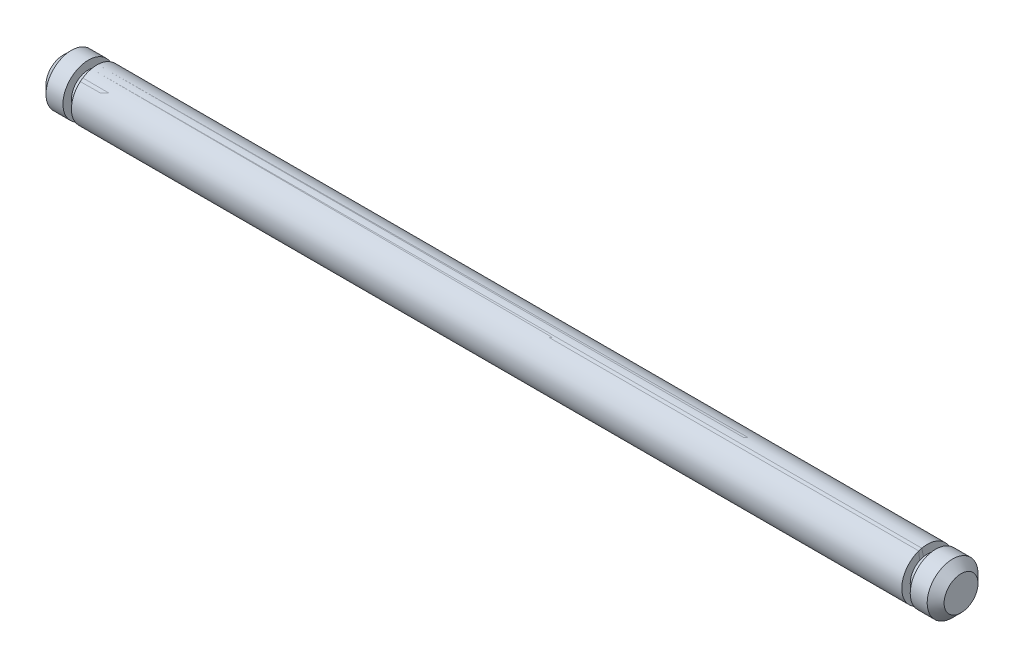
ISO-10303-21;
HEADER;
FILE_DESCRIPTION(('STEP AP214'),'2;1');
FILE_NAME('part.step','',(''),(''),'','','');
FILE_SCHEMA(('AUTOMOTIVE_DESIGN { 1 0 10303 214 1 1 1 1 }'));
ENDSEC;
DATA;
#1=APPLICATION_CONTEXT('core data for automotive mechanical design processes');
#2=APPLICATION_PROTOCOL_DEFINITION('international standard','automotive_design',2000,#1);
#3=PRODUCT_CONTEXT('',#1,'mechanical');
#4=PRODUCT('Part','Part','',(#3));
#5=PRODUCT_RELATED_PRODUCT_CATEGORY('part','',(#4));
#6=PRODUCT_DEFINITION_FORMATION('','',#4);
#7=PRODUCT_DEFINITION_CONTEXT('part definition',#1,'design');
#8=PRODUCT_DEFINITION('design','',#6,#7);
#9=PRODUCT_DEFINITION_SHAPE('','',#8);
#10=(LENGTH_UNIT() NAMED_UNIT(*) SI_UNIT(.MILLI.,.METRE.));
#11=(NAMED_UNIT(*) PLANE_ANGLE_UNIT() SI_UNIT($,.RADIAN.));
#12=(NAMED_UNIT(*) SI_UNIT($,.STERADIAN.) SOLID_ANGLE_UNIT());
#13=UNCERTAINTY_MEASURE_WITH_UNIT(LENGTH_MEASURE(1.E-05),#10,'distance_accuracy_value','');
#14=(GEOMETRIC_REPRESENTATION_CONTEXT(3) GLOBAL_UNCERTAINTY_ASSIGNED_CONTEXT((#13)) GLOBAL_UNIT_ASSIGNED_CONTEXT((#10,
#11,#12)) REPRESENTATION_CONTEXT('',''));
#15=CARTESIAN_POINT('',(0.,0.,0.));
#16=DIRECTION('',(0.,0.,1.));
#17=DIRECTION('',(1.,0.,0.));
#18=AXIS2_PLACEMENT_3D('',#15,#16,#17);
#19=CARTESIAN_POINT('',(-66.5,-1.3968022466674,0.22123174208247));
#20=DIRECTION('',(-1.,0.,0.));
#21=DIRECTION('',(0.,0.809016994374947,0.587785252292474));
#22=AXIS2_PLACEMENT_3D('',#19,#20,#21);
#23=PLANE('',#22);
#24=CARTESIAN_POINT('',(-66.5,0.,0.));
#25=DIRECTION('',(1.,0.,0.));
#26=DIRECTION('',(0.,0.,-1.));
#27=AXIS2_PLACEMENT_3D('',#24,#25,#26);
#28=CIRCLE('',#27,1.);
#29=CARTESIAN_POINT('',(-66.5,0.,-1.));
#30=VERTEX_POINT('',#29);
#31=EDGE_CURVE('P0_E406',#30,#30,#28,.F.);
#32=ORIENTED_EDGE('',*,*,#31,.T.);
#33=EDGE_LOOP('',(#32));
#34=FACE_BOUND('',#33,.T.);
#35=ADVANCED_FACE('P0_F348',(#34),#23,.T.);
#36=CARTESIAN_POINT('',(-66.,0.,0.));
#37=DIRECTION('',(1.,0.,0.));
#38=DIRECTION('',(0.,0.,-1.));
#39=AXIS2_PLACEMENT_3D('',#36,#37,#38);
#40=CONICAL_SURFACE('',#39,1.49999999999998,0.785398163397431);
#41=ORIENTED_EDGE('',*,*,#31,.F.);
#42=EDGE_LOOP('',(#41));
#43=FACE_BOUND('',#42,.T.);
#44=CARTESIAN_POINT('',(-66.,0.,0.));
#45=DIRECTION('',(-1.,0.,0.));
#46=DIRECTION('',(0.,0.809016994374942,0.58778525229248));
#47=AXIS2_PLACEMENT_3D('',#44,#45,#46);
#48=CIRCLE('',#47,1.49999999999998);
#49=CARTESIAN_POINT('',(-66.,1.2135254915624,0.88167787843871));
#50=VERTEX_POINT('',#49);
#51=EDGE_CURVE('P0_E404',#50,#50,#48,.T.);
#52=ORIENTED_EDGE('',*,*,#51,.T.);
#53=EDGE_LOOP('',(#52));
#54=FACE_BOUND('',#53,.T.);
#55=ADVANCED_FACE('P0_F442',(#43,#54),#40,.T.);
#56=CARTESIAN_POINT('',(-65.,0.,0.));
#57=DIRECTION('',(-1.,0.,0.));
#58=DIRECTION('',(0.,0.,1.));
#59=AXIS2_PLACEMENT_3D('',#56,#57,#58);
#60=CYLINDRICAL_SURFACE('',#59,1.49999999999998);
#61=ORIENTED_EDGE('',*,*,#51,.F.);
#62=EDGE_LOOP('',(#61));
#63=FACE_BOUND('',#62,.T.);
#64=CARTESIAN_POINT('',(-65.,0.,0.));
#65=DIRECTION('',(-1.,0.,0.));
#66=DIRECTION('',(0.,0.,1.));
#67=AXIS2_PLACEMENT_3D('',#64,#65,#66);
#68=CIRCLE('',#67,1.49999999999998);
#69=CARTESIAN_POINT('',(-65.,0.,1.49999999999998));
#70=VERTEX_POINT('',#69);
#71=EDGE_CURVE('P0_E399',#70,#70,#68,.F.);
#72=ORIENTED_EDGE('',*,*,#71,.F.);
#73=EDGE_LOOP('',(#72));
#74=FACE_BOUND('',#73,.T.);
#75=ADVANCED_FACE('P0_F447',(#63,#74),#60,.T.);
#76=CARTESIAN_POINT('',(-65.,-0.33184761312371,-2.0952033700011));
#77=DIRECTION('',(1.,0.,0.));
#78=DIRECTION('',(0.,0.809016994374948,0.587785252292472));
#79=AXIS2_PLACEMENT_3D('',#76,#77,#78);
#80=PLANE('',#79);
#81=CARTESIAN_POINT('',(-65.,0.,0.));
#82=DIRECTION('',(-1.,0.,0.));
#83=DIRECTION('',(0.,0.,1.));
#84=AXIS2_PLACEMENT_3D('',#81,#82,#83);
#85=CIRCLE('',#84,1.);
#86=CARTESIAN_POINT('',(-65.,0.,1.));
#87=VERTEX_POINT('',#86);
#88=EDGE_CURVE('P0_E394',#87,#87,#85,.T.);
#89=ORIENTED_EDGE('',*,*,#88,.T.);
#90=EDGE_LOOP('',(#89));
#91=FACE_BOUND('',#90,.T.);
#92=ORIENTED_EDGE('',*,*,#71,.T.);
#93=EDGE_LOOP('',(#92));
#94=FACE_BOUND('',#93,.T.);
#95=ADVANCED_FACE('P0_F443',(#91,#94),#80,.T.);
#96=CARTESIAN_POINT('',(-64.5,0.,0.));
#97=DIRECTION('',(-1.,0.,0.));
#98=DIRECTION('',(0.,0.,1.));
#99=AXIS2_PLACEMENT_3D('',#96,#97,#98);
#100=CYLINDRICAL_SURFACE('',#99,1.);
#101=ORIENTED_EDGE('',*,*,#88,.F.);
#102=EDGE_LOOP('',(#101));
#103=FACE_BOUND('',#102,.T.);
#104=CARTESIAN_POINT('',(-64.5,0.,0.));
#105=DIRECTION('',(-1.,0.,0.));
#106=DIRECTION('',(0.,0.,1.));
#107=AXIS2_PLACEMENT_3D('',#104,#105,#106);
#108=CIRCLE('',#107,1.);
#109=CARTESIAN_POINT('',(-64.5,0.,1.));
#110=VERTEX_POINT('',#109);
#111=EDGE_CURVE('P0_E389',#110,#110,#108,.F.);
#112=ORIENTED_EDGE('',*,*,#111,.F.);
#113=EDGE_LOOP('',(#112));
#114=FACE_BOUND('',#113,.T.);
#115=ADVANCED_FACE('P0_F446',(#103,#114),#100,.T.);
#116=CARTESIAN_POINT('',(-64.5,-2.0952033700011,0.33184761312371));
#117=DIRECTION('',(-1.,0.,0.));
#118=DIRECTION('',(0.,0.809016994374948,0.587785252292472));
#119=AXIS2_PLACEMENT_3D('',#116,#117,#118);
#120=PLANE('',#119);
#121=ORIENTED_EDGE('',*,*,#111,.T.);
#122=EDGE_LOOP('',(#121));
#123=FACE_BOUND('',#122,.T.);
#124=CARTESIAN_POINT('',(-64.5,0.,0.));
#125=DIRECTION('',(-1.,0.,0.));
#126=DIRECTION('',(0.,0.,1.));
#127=AXIS2_PLACEMENT_3D('',#124,#125,#126);
#128=CIRCLE('',#127,1.49999999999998);
#129=CARTESIAN_POINT('',(-64.5,0.,1.49999999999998));
#130=VERTEX_POINT('',#129);
#131=EDGE_CURVE('P0_E384',#130,#130,#128,.T.);
#132=ORIENTED_EDGE('',*,*,#131,.T.);
#133=EDGE_LOOP('',(#132));
#134=FACE_BOUND('',#133,.T.);
#135=ADVANCED_FACE('P0_F449',(#123,#134),#120,.T.);
#136=CARTESIAN_POINT('',(-13.5,-0.22123174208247,-1.3968022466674));
#137=DIRECTION('',(1.,0.,0.));
#138=DIRECTION('',(0.,0.809016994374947,0.587785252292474));
#139=AXIS2_PLACEMENT_3D('',#136,#137,#138);
#140=PLANE('',#139);
#141=CARTESIAN_POINT('',(-13.5,0.,0.));
#142=DIRECTION('',(-1.,0.,0.));
#143=DIRECTION('',(0.,0.,1.));
#144=AXIS2_PLACEMENT_3D('',#141,#142,#143);
#145=CIRCLE('',#144,1.);
#146=CARTESIAN_POINT('',(-13.5,0.,1.));
#147=VERTEX_POINT('',#146);
#148=EDGE_CURVE('P0_E379',#147,#147,#145,.F.);
#149=ORIENTED_EDGE('',*,*,#148,.T.);
#150=EDGE_LOOP('',(#149));
#151=FACE_BOUND('',#150,.T.);
#152=ADVANCED_FACE('P0_F452',(#151),#140,.T.);
#153=CARTESIAN_POINT('',(-15.5,0.,0.));
#154=DIRECTION('',(-1.,0.,0.));
#155=DIRECTION('',(0.,0.,1.));
#156=AXIS2_PLACEMENT_3D('',#153,#154,#155);
#157=CYLINDRICAL_SURFACE('',#156,1.49999999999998);
#158=ORIENTED_EDGE('',*,*,#131,.F.);
#159=EDGE_LOOP('',(#158));
#160=FACE_BOUND('',#159,.T.);
#161=CARTESIAN_POINT('',(-15.5,0.,0.));
#162=DIRECTION('',(-1.,0.,0.));
#163=DIRECTION('',(0.,0.,1.));
#164=AXIS2_PLACEMENT_3D('',#161,#162,#163);
#165=CIRCLE('',#164,1.49999999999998);
#166=CARTESIAN_POINT('',(-15.5,0.,1.49999999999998));
#167=VERTEX_POINT('',#166);
#168=EDGE_CURVE('P0_E376',#167,#167,#165,.F.);
#169=ORIENTED_EDGE('',*,*,#168,.F.);
#170=EDGE_LOOP('',(#169));
#171=FACE_BOUND('',#170,.T.);
#172=ADVANCED_FACE('P0_F455',(#160,#171),#157,.T.);
#173=CARTESIAN_POINT('',(-13.5,0.,0.));
#174=DIRECTION('',(-1.,0.,0.));
#175=DIRECTION('',(0.,0.,1.));
#176=AXIS2_PLACEMENT_3D('',#173,#174,#175);
#177=CONICAL_SURFACE('',#176,1.,0.785398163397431);
#178=ORIENTED_EDGE('',*,*,#148,.F.);
#179=EDGE_LOOP('',(#178));
#180=FACE_BOUND('',#179,.T.);
#181=CARTESIAN_POINT('',(-14.,0.,0.));
#182=DIRECTION('',(-1.,0.,0.));
#183=DIRECTION('',(0.,0.809016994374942,0.58778525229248));
#184=AXIS2_PLACEMENT_3D('',#181,#182,#183);
#185=CIRCLE('',#184,1.49999999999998);
#186=CARTESIAN_POINT('',(-14.,1.2135254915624,0.88167787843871));
#187=VERTEX_POINT('',#186);
#188=EDGE_CURVE('P0_E373',#187,#187,#185,.F.);
#189=ORIENTED_EDGE('',*,*,#188,.T.);
#190=EDGE_LOOP('',(#189));
#191=FACE_BOUND('',#190,.T.);
#192=ADVANCED_FACE('P0_F419',(#180,#191),#177,.T.);
#193=CARTESIAN_POINT('',(-15.5,-0.33184761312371,-2.0952033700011));
#194=DIRECTION('',(1.,0.,0.));
#195=DIRECTION('',(0.,0.809016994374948,0.587785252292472));
#196=AXIS2_PLACEMENT_3D('',#193,#194,#195);
#197=PLANE('',#196);
#198=CARTESIAN_POINT('',(-15.5,0.,0.));
#199=DIRECTION('',(-1.,0.,0.));
#200=DIRECTION('',(0.,0.,1.));
#201=AXIS2_PLACEMENT_3D('',#198,#199,#200);
#202=CIRCLE('',#201,1.);
#203=CARTESIAN_POINT('',(-15.5,0.,1.));
#204=VERTEX_POINT('',#203);
#205=EDGE_CURVE('P0_E361',#204,#204,#202,.T.);
#206=ORIENTED_EDGE('',*,*,#205,.T.);
#207=EDGE_LOOP('',(#206));
#208=FACE_BOUND('',#207,.T.);
#209=ORIENTED_EDGE('',*,*,#168,.T.);
#210=EDGE_LOOP('',(#209));
#211=FACE_BOUND('',#210,.T.);
#212=ADVANCED_FACE('P0_F425',(#208,#211),#197,.T.);
#213=CARTESIAN_POINT('',(-14.,0.,0.));
#214=DIRECTION('',(-1.,0.,0.));
#215=DIRECTION('',(0.,0.,1.));
#216=AXIS2_PLACEMENT_3D('',#213,#214,#215);
#217=CYLINDRICAL_SURFACE('',#216,1.49999999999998);
#218=ORIENTED_EDGE('',*,*,#188,.F.);
#219=EDGE_LOOP('',(#218));
#220=FACE_BOUND('',#219,.T.);
#221=CARTESIAN_POINT('',(-15.,0.,0.));
#222=DIRECTION('',(-1.,0.,0.));
#223=DIRECTION('',(0.,0.,1.));
#224=AXIS2_PLACEMENT_3D('',#221,#222,#223);
#225=CIRCLE('',#224,1.49999999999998);
#226=CARTESIAN_POINT('',(-15.,0.,1.49999999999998));
#227=VERTEX_POINT('',#226);
#228=EDGE_CURVE('P0_E356',#227,#227,#225,.T.);
#229=ORIENTED_EDGE('',*,*,#228,.F.);
#230=EDGE_LOOP('',(#229));
#231=FACE_BOUND('',#230,.T.);
#232=ADVANCED_FACE('P0_F421',(#220,#231),#217,.T.);
#233=CARTESIAN_POINT('',(-15.,0.,0.));
#234=DIRECTION('',(-1.,0.,0.));
#235=DIRECTION('',(0.,0.,1.));
#236=AXIS2_PLACEMENT_3D('',#233,#234,#235);
#237=CYLINDRICAL_SURFACE('',#236,1.);
#238=CARTESIAN_POINT('',(-15.,0.,0.));
#239=DIRECTION('',(-1.,0.,0.));
#240=DIRECTION('',(0.,0.,1.));
#241=AXIS2_PLACEMENT_3D('',#238,#239,#240);
#242=CIRCLE('',#241,1.);
#243=CARTESIAN_POINT('',(-15.,0.,1.));
#244=VERTEX_POINT('',#243);
#245=EDGE_CURVE('P0_E10',#244,#244,#242,.F.);
#246=ORIENTED_EDGE('',*,*,#245,.F.);
#247=EDGE_LOOP('',(#246));
#248=FACE_BOUND('',#247,.T.);
#249=ORIENTED_EDGE('',*,*,#205,.F.);
#250=EDGE_LOOP('',(#249));
#251=FACE_BOUND('',#250,.T.);
#252=ADVANCED_FACE('P0_F424',(#248,#251),#237,.T.);
#253=CARTESIAN_POINT('',(-15.,-2.0952033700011,0.33184761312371));
#254=DIRECTION('',(-1.,0.,0.));
#255=DIRECTION('',(0.,0.809016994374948,0.587785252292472));
#256=AXIS2_PLACEMENT_3D('',#253,#254,#255);
#257=PLANE('',#256);
#258=ORIENTED_EDGE('',*,*,#245,.T.);
#259=EDGE_LOOP('',(#258));
#260=FACE_BOUND('',#259,.T.);
#261=ORIENTED_EDGE('',*,*,#228,.T.);
#262=EDGE_LOOP('',(#261));
#263=FACE_BOUND('',#262,.T.);
#264=ADVANCED_FACE('P0_F350',(#260,#263),#257,.T.);
#265=CLOSED_SHELL('',(#35,#55,#75,#95,#115,#135,#152,#172,#192,#212,#232,#252,#264));
#266=MANIFOLD_SOLID_BREP('P0_B2',#265);
#267=CARTESIAN_POINT('',(-66.5,-1.3968022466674,0.22123174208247));
#268=DIRECTION('',(-1.,0.,0.));
#269=DIRECTION('',(0.,0.809016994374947,0.587785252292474));
#270=AXIS2_PLACEMENT_3D('',#267,#268,#269);
#271=PLANE('',#270);
#272=CARTESIAN_POINT('',(-66.5,0.,0.));
#273=DIRECTION('',(1.,0.,0.));
#274=DIRECTION('',(0.,0.,-1.));
#275=AXIS2_PLACEMENT_3D('',#272,#273,#274);
#276=CIRCLE('',#275,1.);
#277=CARTESIAN_POINT('',(-66.5,0.,-1.));
#278=VERTEX_POINT('',#277);
#279=EDGE_CURVE('P1_E72',#278,#278,#276,.F.);
#280=ORIENTED_EDGE('',*,*,#279,.T.);
#281=EDGE_LOOP('',(#280));
#282=FACE_BOUND('',#281,.T.);
#283=ADVANCED_FACE('P1_F14',(#282),#271,.T.);
#284=CARTESIAN_POINT('',(-66.,0.,0.));
#285=DIRECTION('',(1.,0.,0.));
#286=DIRECTION('',(0.,0.,-1.));
#287=AXIS2_PLACEMENT_3D('',#284,#285,#286);
#288=CONICAL_SURFACE('',#287,1.49999999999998,0.785398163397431);
#289=ORIENTED_EDGE('',*,*,#279,.F.);
#290=EDGE_LOOP('',(#289));
#291=FACE_BOUND('',#290,.T.);
#292=CARTESIAN_POINT('',(-66.,0.,0.));
#293=DIRECTION('',(-1.,0.,0.));
#294=DIRECTION('',(0.,0.809016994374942,0.58778525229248));
#295=AXIS2_PLACEMENT_3D('',#292,#293,#294);
#296=CIRCLE('',#295,1.49999999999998);
#297=CARTESIAN_POINT('',(-66.,1.2135254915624,0.88167787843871));
#298=VERTEX_POINT('',#297);
#299=EDGE_CURVE('P1_E70',#298,#298,#296,.T.);
#300=ORIENTED_EDGE('',*,*,#299,.T.);
#301=EDGE_LOOP('',(#300));
#302=FACE_BOUND('',#301,.T.);
#303=ADVANCED_FACE('P1_F100',(#291,#302),#288,.T.);
#304=CARTESIAN_POINT('',(-65.,0.,0.));
#305=DIRECTION('',(-1.,0.,0.));
#306=DIRECTION('',(0.,0.,1.));
#307=AXIS2_PLACEMENT_3D('',#304,#305,#306);
#308=CYLINDRICAL_SURFACE('',#307,1.49999999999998);
#309=ORIENTED_EDGE('',*,*,#299,.F.);
#310=EDGE_LOOP('',(#309));
#311=FACE_BOUND('',#310,.T.);
#312=CARTESIAN_POINT('',(-65.,0.,0.));
#313=DIRECTION('',(-1.,0.,0.));
#314=DIRECTION('',(0.,0.,1.));
#315=AXIS2_PLACEMENT_3D('',#312,#313,#314);
#316=CIRCLE('',#315,1.49999999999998);
#317=CARTESIAN_POINT('',(-65.,0.,1.49999999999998));
#318=VERTEX_POINT('',#317);
#319=EDGE_CURVE('P1_E65',#318,#318,#316,.F.);
#320=ORIENTED_EDGE('',*,*,#319,.F.);
#321=EDGE_LOOP('',(#320));
#322=FACE_BOUND('',#321,.T.);
#323=ADVANCED_FACE('P1_F104',(#311,#322),#308,.T.);
#324=CARTESIAN_POINT('',(-65.,-0.33184761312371,-2.0952033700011));
#325=DIRECTION('',(1.,0.,0.));
#326=DIRECTION('',(0.,0.809016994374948,0.587785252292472));
#327=AXIS2_PLACEMENT_3D('',#324,#325,#326);
#328=PLANE('',#327);
#329=CARTESIAN_POINT('',(-65.,0.,0.));
#330=DIRECTION('',(-1.,0.,0.));
#331=DIRECTION('',(0.,0.,1.));
#332=AXIS2_PLACEMENT_3D('',#329,#330,#331);
#333=CIRCLE('',#332,1.);
#334=CARTESIAN_POINT('',(-65.,0.,1.));
#335=VERTEX_POINT('',#334);
#336=EDGE_CURVE('P1_E60',#335,#335,#333,.T.);
#337=ORIENTED_EDGE('',*,*,#336,.T.);
#338=EDGE_LOOP('',(#337));
#339=FACE_BOUND('',#338,.T.);
#340=ORIENTED_EDGE('',*,*,#319,.T.);
#341=EDGE_LOOP('',(#340));
#342=FACE_BOUND('',#341,.T.);
#343=ADVANCED_FACE('P1_F101',(#339,#342),#328,.T.);
#344=CARTESIAN_POINT('',(-64.5,0.,0.));
#345=DIRECTION('',(-1.,0.,0.));
#346=DIRECTION('',(0.,0.,1.));
#347=AXIS2_PLACEMENT_3D('',#344,#345,#346);
#348=CYLINDRICAL_SURFACE('',#347,1.);
#349=ORIENTED_EDGE('',*,*,#336,.F.);
#350=EDGE_LOOP('',(#349));
#351=FACE_BOUND('',#350,.T.);
#352=CARTESIAN_POINT('',(-64.5,0.,0.));
#353=DIRECTION('',(-1.,0.,0.));
#354=DIRECTION('',(0.,0.,1.));
#355=AXIS2_PLACEMENT_3D('',#352,#353,#354);
#356=CIRCLE('',#355,1.);
#357=CARTESIAN_POINT('',(-64.5,0.,1.));
#358=VERTEX_POINT('',#357);
#359=EDGE_CURVE('P1_E55',#358,#358,#356,.F.);
#360=ORIENTED_EDGE('',*,*,#359,.F.);
#361=EDGE_LOOP('',(#360));
#362=FACE_BOUND('',#361,.T.);
#363=ADVANCED_FACE('P1_F103',(#351,#362),#348,.T.);
#364=CARTESIAN_POINT('',(-64.5,-2.0952033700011,0.33184761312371));
#365=DIRECTION('',(-1.,0.,0.));
#366=DIRECTION('',(0.,0.809016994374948,0.587785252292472));
#367=AXIS2_PLACEMENT_3D('',#364,#365,#366);
#368=PLANE('',#367);
#369=ORIENTED_EDGE('',*,*,#359,.T.);
#370=EDGE_LOOP('',(#369));
#371=FACE_BOUND('',#370,.T.);
#372=CARTESIAN_POINT('',(-64.5,0.,0.));
#373=DIRECTION('',(-1.,0.,0.));
#374=DIRECTION('',(0.,0.,1.));
#375=AXIS2_PLACEMENT_3D('',#372,#373,#374);
#376=CIRCLE('',#375,1.49999999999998);
#377=CARTESIAN_POINT('',(-64.5,0.,1.49999999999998));
#378=VERTEX_POINT('',#377);
#379=EDGE_CURVE('P1_E50',#378,#378,#376,.T.);
#380=ORIENTED_EDGE('',*,*,#379,.T.);
#381=EDGE_LOOP('',(#380));
#382=FACE_BOUND('',#381,.T.);
#383=ADVANCED_FACE('P1_F106',(#371,#382),#368,.T.);
#384=CARTESIAN_POINT('',(-13.5,-0.22123174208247,-1.3968022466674));
#385=DIRECTION('',(1.,0.,0.));
#386=DIRECTION('',(0.,0.809016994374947,0.587785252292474));
#387=AXIS2_PLACEMENT_3D('',#384,#385,#386);
#388=PLANE('',#387);
#389=CARTESIAN_POINT('',(-13.5,0.,0.));
#390=DIRECTION('',(-1.,0.,0.));
#391=DIRECTION('',(0.,0.,1.));
#392=AXIS2_PLACEMENT_3D('',#389,#390,#391);
#393=CIRCLE('',#392,1.);
#394=CARTESIAN_POINT('',(-13.5,0.,1.));
#395=VERTEX_POINT('',#394);
#396=EDGE_CURVE('P1_E45',#395,#395,#393,.F.);
#397=ORIENTED_EDGE('',*,*,#396,.T.);
#398=EDGE_LOOP('',(#397));
#399=FACE_BOUND('',#398,.T.);
#400=ADVANCED_FACE('P1_F108',(#399),#388,.T.);
#401=CARTESIAN_POINT('',(-15.5,0.,0.));
#402=DIRECTION('',(-1.,0.,0.));
#403=DIRECTION('',(0.,0.,1.));
#404=AXIS2_PLACEMENT_3D('',#401,#402,#403);
#405=CYLINDRICAL_SURFACE('',#404,1.49999999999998);
#406=ORIENTED_EDGE('',*,*,#379,.F.);
#407=EDGE_LOOP('',(#406));
#408=FACE_BOUND('',#407,.T.);
#409=CARTESIAN_POINT('',(-15.5,0.,0.));
#410=DIRECTION('',(-1.,0.,0.));
#411=DIRECTION('',(0.,0.,1.));
#412=AXIS2_PLACEMENT_3D('',#409,#410,#411);
#413=CIRCLE('',#412,1.49999999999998);
#414=CARTESIAN_POINT('',(-15.5,0.,1.49999999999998));
#415=VERTEX_POINT('',#414);
#416=EDGE_CURVE('P1_E42',#415,#415,#413,.F.);
#417=ORIENTED_EDGE('',*,*,#416,.F.);
#418=EDGE_LOOP('',(#417));
#419=FACE_BOUND('',#418,.T.);
#420=ADVANCED_FACE('P1_F110',(#408,#419),#405,.T.);
#421=CARTESIAN_POINT('',(-13.5,0.,0.));
#422=DIRECTION('',(-1.,0.,0.));
#423=DIRECTION('',(0.,0.,1.));
#424=AXIS2_PLACEMENT_3D('',#421,#422,#423);
#425=CONICAL_SURFACE('',#424,1.,0.785398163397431);
#426=ORIENTED_EDGE('',*,*,#396,.F.);
#427=EDGE_LOOP('',(#426));
#428=FACE_BOUND('',#427,.T.);
#429=CARTESIAN_POINT('',(-14.,0.,0.));
#430=DIRECTION('',(-1.,0.,0.));
#431=DIRECTION('',(0.,0.809016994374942,0.58778525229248));
#432=AXIS2_PLACEMENT_3D('',#429,#430,#431);
#433=CIRCLE('',#432,1.49999999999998);
#434=CARTESIAN_POINT('',(-14.,1.2135254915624,0.88167787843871));
#435=VERTEX_POINT('',#434);
#436=EDGE_CURVE('P1_E39',#435,#435,#433,.F.);
#437=ORIENTED_EDGE('',*,*,#436,.T.);
#438=EDGE_LOOP('',(#437));
#439=FACE_BOUND('',#438,.T.);
#440=ADVANCED_FACE('P1_F85',(#428,#439),#425,.T.);
#441=CARTESIAN_POINT('',(-15.5,-0.33184761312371,-2.0952033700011));
#442=DIRECTION('',(1.,0.,0.));
#443=DIRECTION('',(0.,0.809016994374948,0.587785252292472));
#444=AXIS2_PLACEMENT_3D('',#441,#442,#443);
#445=PLANE('',#444);
#446=CARTESIAN_POINT('',(-15.5,0.,0.));
#447=DIRECTION('',(-1.,0.,0.));
#448=DIRECTION('',(0.,0.,1.));
#449=AXIS2_PLACEMENT_3D('',#446,#447,#448);
#450=CIRCLE('',#449,1.);
#451=CARTESIAN_POINT('',(-15.5,0.,1.));
#452=VERTEX_POINT('',#451);
#453=EDGE_CURVE('P1_E27',#452,#452,#450,.T.);
#454=ORIENTED_EDGE('',*,*,#453,.T.);
#455=EDGE_LOOP('',(#454));
#456=FACE_BOUND('',#455,.T.);
#457=ORIENTED_EDGE('',*,*,#416,.T.);
#458=EDGE_LOOP('',(#457));
#459=FACE_BOUND('',#458,.T.);
#460=ADVANCED_FACE('P1_F90',(#456,#459),#445,.T.);
#461=CARTESIAN_POINT('',(-14.,0.,0.));
#462=DIRECTION('',(-1.,0.,0.));
#463=DIRECTION('',(0.,0.,1.));
#464=AXIS2_PLACEMENT_3D('',#461,#462,#463);
#465=CYLINDRICAL_SURFACE('',#464,1.49999999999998);
#466=ORIENTED_EDGE('',*,*,#436,.F.);
#467=EDGE_LOOP('',(#466));
#468=FACE_BOUND('',#467,.T.);
#469=CARTESIAN_POINT('',(-15.,0.,0.));
#470=DIRECTION('',(-1.,0.,0.));
#471=DIRECTION('',(0.,0.,1.));
#472=AXIS2_PLACEMENT_3D('',#469,#470,#471);
#473=CIRCLE('',#472,1.49999999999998);
#474=CARTESIAN_POINT('',(-15.,0.,1.49999999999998));
#475=VERTEX_POINT('',#474);
#476=EDGE_CURVE('P1_E22',#475,#475,#473,.T.);
#477=ORIENTED_EDGE('',*,*,#476,.F.);
#478=EDGE_LOOP('',(#477));
#479=FACE_BOUND('',#478,.T.);
#480=ADVANCED_FACE('P1_F87',(#468,#479),#465,.T.);
#481=CARTESIAN_POINT('',(-15.,0.,0.));
#482=DIRECTION('',(-1.,0.,0.));
#483=DIRECTION('',(0.,0.,1.));
#484=AXIS2_PLACEMENT_3D('',#481,#482,#483);
#485=CYLINDRICAL_SURFACE('',#484,1.);
#486=CARTESIAN_POINT('',(-15.,0.,0.));
#487=DIRECTION('',(-1.,0.,0.));
#488=DIRECTION('',(0.,0.,1.));
#489=AXIS2_PLACEMENT_3D('',#486,#487,#488);
#490=CIRCLE('',#489,1.);
#491=CARTESIAN_POINT('',(-15.,0.,1.));
#492=VERTEX_POINT('',#491);
#493=EDGE_CURVE('P1_E9',#492,#492,#490,.F.);
#494=ORIENTED_EDGE('',*,*,#493,.F.);
#495=EDGE_LOOP('',(#494));
#496=FACE_BOUND('',#495,.T.);
#497=ORIENTED_EDGE('',*,*,#453,.F.);
#498=EDGE_LOOP('',(#497));
#499=FACE_BOUND('',#498,.T.);
#500=ADVANCED_FACE('P1_F89',(#496,#499),#485,.T.);
#501=CARTESIAN_POINT('',(-15.,-2.0952033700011,0.33184761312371));
#502=DIRECTION('',(-1.,0.,0.));
#503=DIRECTION('',(0.,0.809016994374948,0.587785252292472));
#504=AXIS2_PLACEMENT_3D('',#501,#502,#503);
#505=PLANE('',#504);
#506=ORIENTED_EDGE('',*,*,#493,.T.);
#507=EDGE_LOOP('',(#506));
#508=FACE_BOUND('',#507,.T.);
#509=ORIENTED_EDGE('',*,*,#476,.T.);
#510=EDGE_LOOP('',(#509));
#511=FACE_BOUND('',#510,.T.);
#512=ADVANCED_FACE('P1_F16',(#508,#511),#505,.T.);
#513=CLOSED_SHELL('',(#283,#303,#323,#343,#363,#383,#400,#420,#440,#460,#480,#500,#512));
#514=MANIFOLD_SOLID_BREP('P1_B1',#513);
#515=ADVANCED_BREP_SHAPE_REPRESENTATION('',(#18,#266,#514),#14);
#516=SHAPE_DEFINITION_REPRESENTATION(#9,#515);
ENDSEC;
END-ISO-10303-21;
